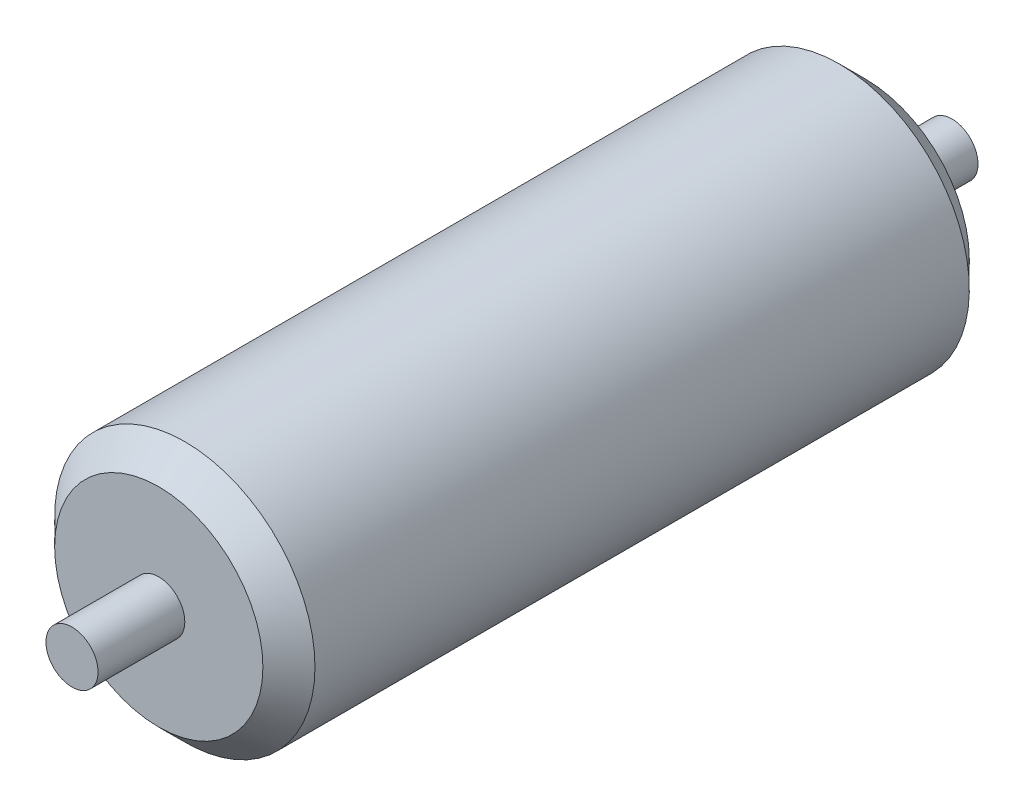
from build123d import *

# Parameters (mm, degrees)
SKETCH_1_R      = 150
EXTRUDE_1_DEPTH = 377
SKETCH_3_R      = 30
EXTRUDE_2_DEPTH = 100


with BuildPart() as part:
    # Sketch 1 → Extrude 1 (new, symmetric)
    with BuildSketch(Plane.XY):
        Circle(SKETCH_1_R)
    extrude(amount=EXTRUDE_1_DEPTH, both=True)

    # Sketch 2 → Revolve 1 (revolve)
    with BuildSketch(Plane(origin=(0, 0, 0), x_dir=(0, 0, -1), z_dir=(1, 0, 0))):
        Polygon((-377, 0), (-407, 0), (-407, 120), (-377, 150), align=None)
    revolve_1 = revolve(axis=Axis((0, 0, 377), (0, 0, 1)))

    # Mirror 1: Revolve 1 across plane
    add(revolve_1.mirror(Plane.XY))

    # Sketch 3 → Extrude 2 (add)
    with BuildSketch(Plane.XY.offset(407)):
        Circle(SKETCH_3_R)
    extrude_2 = extrude(amount=EXTRUDE_2_DEPTH)

    # Mirror 2: Extrude 2 across plane
    add(extrude_2.mirror(Plane.XY))


solid = part.part
